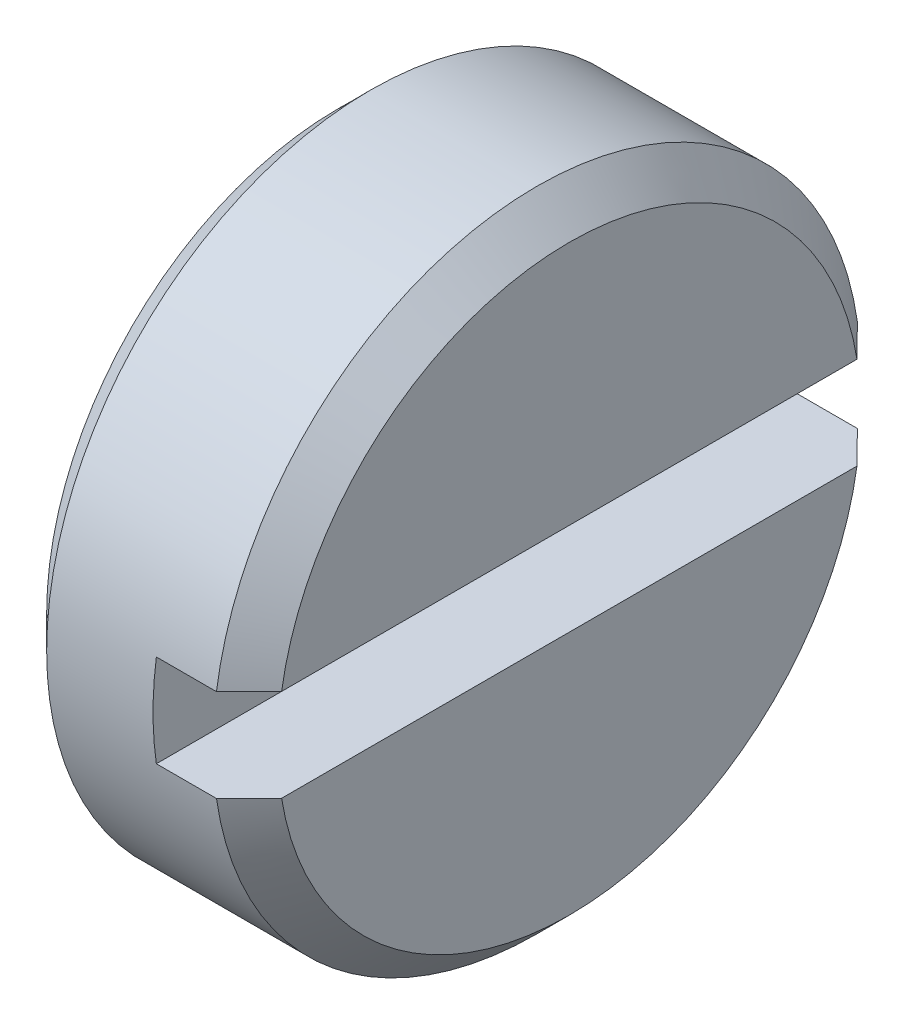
ISO-10303-21;
HEADER;
FILE_DESCRIPTION(('STEP AP214'),'2;1');
FILE_NAME('part.step','',(''),(''),'','','');
FILE_SCHEMA(('AUTOMOTIVE_DESIGN { 1 0 10303 214 1 1 1 1 }'));
ENDSEC;
DATA;
#1=APPLICATION_CONTEXT('core data for automotive mechanical design processes');
#2=APPLICATION_PROTOCOL_DEFINITION('international standard','automotive_design',2000,#1);
#3=PRODUCT_CONTEXT('',#1,'mechanical');
#4=PRODUCT('Part','Part','',(#3));
#5=PRODUCT_RELATED_PRODUCT_CATEGORY('part','',(#4));
#6=PRODUCT_DEFINITION_FORMATION('','',#4);
#7=PRODUCT_DEFINITION_CONTEXT('part definition',#1,'design');
#8=PRODUCT_DEFINITION('design','',#6,#7);
#9=PRODUCT_DEFINITION_SHAPE('','',#8);
#10=(LENGTH_UNIT() NAMED_UNIT(*) SI_UNIT(.MILLI.,.METRE.));
#11=(NAMED_UNIT(*) PLANE_ANGLE_UNIT() SI_UNIT($,.RADIAN.));
#12=(NAMED_UNIT(*) SI_UNIT($,.STERADIAN.) SOLID_ANGLE_UNIT());
#13=UNCERTAINTY_MEASURE_WITH_UNIT(LENGTH_MEASURE(1.E-05),#10,'distance_accuracy_value','');
#14=(GEOMETRIC_REPRESENTATION_CONTEXT(3) GLOBAL_UNCERTAINTY_ASSIGNED_CONTEXT((#13)) GLOBAL_UNIT_ASSIGNED_CONTEXT((#10,
#11,#12)) REPRESENTATION_CONTEXT('',''));
#15=CARTESIAN_POINT('',(0.,0.,0.));
#16=DIRECTION('',(0.,0.,1.));
#17=DIRECTION('',(1.,0.,0.));
#18=AXIS2_PLACEMENT_3D('',#15,#16,#17);
#19=CARTESIAN_POINT('',(3.,1.,8.39999999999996));
#20=DIRECTION('',(-1.,0.,0.));
#21=DIRECTION('',(0.,0.,1.));
#22=AXIS2_PLACEMENT_3D('',#19,#20,#21);
#23=PLANE('',#22);
#24=DIRECTION('',(0.,0.,-1.));
#25=VECTOR('',#24,1.);
#26=CARTESIAN_POINT('',(3.,-1.,8.39999999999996));
#27=LINE('',#26,#25);
#28=CARTESIAN_POINT('',(3.,-1.,6.92820323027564));
#29=VERTEX_POINT('',#28);
#30=CARTESIAN_POINT('',(3.,-1.,-6.92820323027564));
#31=VERTEX_POINT('',#30);
#32=EDGE_CURVE('E97',#29,#31,#27,.T.);
#33=ORIENTED_EDGE('',*,*,#32,.T.);
#34=CARTESIAN_POINT('',(3.,0.,0.));
#35=DIRECTION('',(1.,0.,0.));
#36=DIRECTION('',(0.,0.,-1.));
#37=AXIS2_PLACEMENT_3D('',#34,#35,#36);
#38=CIRCLE('',#37,7.);
#39=CARTESIAN_POINT('',(3.,1.,-6.92820323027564));
#40=VERTEX_POINT('',#39);
#41=EDGE_CURVE('E19',#40,#31,#38,.F.);
#42=ORIENTED_EDGE('',*,*,#41,.F.);
#43=DIRECTION('',(0.,0.,1.));
#44=VECTOR('',#43,1.);
#45=CARTESIAN_POINT('',(3.,1.,8.39999999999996));
#46=LINE('',#45,#44);
#47=CARTESIAN_POINT('',(3.,1.,6.92820323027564));
#48=VERTEX_POINT('',#47);
#49=EDGE_CURVE('E82',#40,#48,#46,.T.);
#50=ORIENTED_EDGE('',*,*,#49,.T.);
#51=CARTESIAN_POINT('',(3.,0.,0.));
#52=DIRECTION('',(1.,0.,0.));
#53=DIRECTION('',(0.,0.,-1.));
#54=AXIS2_PLACEMENT_3D('',#51,#52,#53);
#55=CIRCLE('',#54,7.);
#56=EDGE_CURVE('E71',#29,#48,#55,.F.);
#57=ORIENTED_EDGE('',*,*,#56,.F.);
#58=EDGE_LOOP('',(#33,#42,#50,#57));
#59=FACE_BOUND('',#58,.T.);
#60=ADVANCED_FACE('F16',(#59),#23,.F.);
#61=CARTESIAN_POINT('',(3.,-1.,8.39999999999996));
#62=DIRECTION('',(0.,-1.,0.));
#63=DIRECTION('',(0.,0.,-1.));
#64=AXIS2_PLACEMENT_3D('',#61,#62,#63);
#65=PLANE('',#64);
#66=ORIENTED_EDGE('',*,*,#32,.F.);
#67=DIRECTION('',(1.,0.,0.));
#68=VECTOR('',#67,1.);
#69=CARTESIAN_POINT('',(3.,-1.,6.92820323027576));
#70=LINE('',#69,#68);
#71=CARTESIAN_POINT('',(4.2999999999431,-1.,6.92820323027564));
#72=VERTEX_POINT('',#71);
#73=EDGE_CURVE('E78',#72,#29,#70,.F.);
#74=ORIENTED_EDGE('',*,*,#73,.F.);
#75=CARTESIAN_POINT('',(4.99999999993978,-1.,6.22012861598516));
#76=CARTESIAN_POINT('',(4.88340538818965,-1.,6.33821228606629));
#77=CARTESIAN_POINT('',(4.76677474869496,-1.,6.4562603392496));
#78=CARTESIAN_POINT('',(4.53344141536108,-1.,6.69228521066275));
#79=CARTESIAN_POINT('',(4.41673872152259,-1.,6.81026202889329));
#80=CARTESIAN_POINT('',(4.29999999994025,-1.,6.92820323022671));
#81=B_SPLINE_CURVE_WITH_KNOTS('',3,(#75,#76,#77,#78,#79,#80),.UNSPECIFIED.,.F.,.F.,(4,2,4),(0.,
0.497837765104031,0.995675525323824),.UNSPECIFIED.);
#82=CARTESIAN_POINT('',(4.99999999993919,-1.,6.22012861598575));
#83=VERTEX_POINT('',#82);
#84=EDGE_CURVE('E98',#83,#72,#81,.T.);
#85=ORIENTED_EDGE('',*,*,#84,.F.);
#86=DIRECTION('',(0.,0.,-1.));
#87=VECTOR('',#86,1.);
#88=CARTESIAN_POINT('',(5.,-1.,0.));
#89=LINE('',#88,#87);
#90=CARTESIAN_POINT('',(4.99999999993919,-1.,-6.22012861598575));
#91=VERTEX_POINT('',#90);
#92=EDGE_CURVE('E86',#91,#83,#89,.F.);
#93=ORIENTED_EDGE('',*,*,#92,.F.);
#94=CARTESIAN_POINT('',(4.29999999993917,-1.,-6.9282032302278));
#95=CARTESIAN_POINT('',(4.41673872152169,-1.,-6.81026202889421));
#96=CARTESIAN_POINT('',(4.53344141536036,-1.,-6.69228521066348));
#97=CARTESIAN_POINT('',(4.7667747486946,-1.,-6.45626033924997));
#98=CARTESIAN_POINT('',(4.88340538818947,-1.,-6.33821228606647));
#99=CARTESIAN_POINT('',(4.99999999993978,-1.,-6.22012861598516));
#100=B_SPLINE_CURVE_WITH_KNOTS('',3,(#94,#95,#96,#97,#98,#99),.UNSPECIFIED.,.F.,.F.,(4,2,4),(0.,
0.497837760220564,0.995675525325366),.UNSPECIFIED.);
#101=CARTESIAN_POINT('',(4.29999999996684,-1.,-6.92820323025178));
#102=VERTEX_POINT('',#101);
#103=EDGE_CURVE('E80',#102,#91,#100,.T.);
#104=ORIENTED_EDGE('',*,*,#103,.F.);
#105=DIRECTION('',(1.,0.,0.));
#106=VECTOR('',#105,1.);
#107=CARTESIAN_POINT('',(3.,-1.,-6.92820323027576));
#108=LINE('',#107,#106);
#109=EDGE_CURVE('E100',#31,#102,#108,.T.);
#110=ORIENTED_EDGE('',*,*,#109,.F.);
#111=EDGE_LOOP('',(#66,#74,#85,#93,#104,#110));
#112=FACE_BOUND('',#111,.T.);
#113=ADVANCED_FACE('F145',(#112),#65,.F.);
#114=CARTESIAN_POINT('',(5.,1.,8.39999999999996));
#115=DIRECTION('',(0.,1.,0.));
#116=DIRECTION('',(0.,0.,1.));
#117=AXIS2_PLACEMENT_3D('',#114,#115,#116);
#118=PLANE('',#117);
#119=ORIENTED_EDGE('',*,*,#49,.F.);
#120=DIRECTION('',(1.,0.,0.));
#121=VECTOR('',#120,1.);
#122=CARTESIAN_POINT('',(5.,1.,-6.92820323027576));
#123=LINE('',#122,#121);
#124=CARTESIAN_POINT('',(4.2999999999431,1.,-6.92820323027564));
#125=VERTEX_POINT('',#124);
#126=EDGE_CURVE('E88',#125,#40,#123,.F.);
#127=ORIENTED_EDGE('',*,*,#126,.F.);
#128=CARTESIAN_POINT('',(4.99999999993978,1.,-6.22012861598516));
#129=CARTESIAN_POINT('',(4.88340538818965,1.,-6.33821228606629));
#130=CARTESIAN_POINT('',(4.76677474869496,1.,-6.4562603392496));
#131=CARTESIAN_POINT('',(4.53344141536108,1.,-6.69228521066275));
#132=CARTESIAN_POINT('',(4.41673872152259,1.,-6.81026202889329));
#133=CARTESIAN_POINT('',(4.29999999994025,1.,-6.92820323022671));
#134=B_SPLINE_CURVE_WITH_KNOTS('',3,(#128,#129,#130,#131,#132,#133),.UNSPECIFIED.,.F.,.F.,(4,2,
4),(0.,0.497837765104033,0.995675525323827),.UNSPECIFIED.);
#135=CARTESIAN_POINT('',(4.99999999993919,1.,-6.22012861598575));
#136=VERTEX_POINT('',#135);
#137=EDGE_CURVE('E34',#136,#125,#134,.T.);
#138=ORIENTED_EDGE('',*,*,#137,.F.);
#139=DIRECTION('',(0.,0.,-1.));
#140=VECTOR('',#139,1.);
#141=CARTESIAN_POINT('',(5.,1.,0.));
#142=LINE('',#141,#140);
#143=CARTESIAN_POINT('',(4.99999999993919,1.,6.22012861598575));
#144=VERTEX_POINT('',#143);
#145=EDGE_CURVE('E110',#144,#136,#142,.T.);
#146=ORIENTED_EDGE('',*,*,#145,.F.);
#147=CARTESIAN_POINT('',(4.29999999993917,1.,6.9282032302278));
#148=CARTESIAN_POINT('',(4.41673872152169,1.,6.81026202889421));
#149=CARTESIAN_POINT('',(4.53344141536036,1.,6.69228521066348));
#150=CARTESIAN_POINT('',(4.7667747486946,1.,6.45626033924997));
#151=CARTESIAN_POINT('',(4.88340538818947,1.,6.33821228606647));
#152=CARTESIAN_POINT('',(4.99999999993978,1.,6.22012861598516));
#153=B_SPLINE_CURVE_WITH_KNOTS('',3,(#147,#148,#149,#150,#151,#152),.UNSPECIFIED.,.F.,.F.,(4,2,
4),(0.,0.497837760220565,0.995675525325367),.UNSPECIFIED.);
#154=CARTESIAN_POINT('',(4.29999999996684,1.,6.92820323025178));
#155=VERTEX_POINT('',#154);
#156=EDGE_CURVE('E84',#155,#144,#153,.T.);
#157=ORIENTED_EDGE('',*,*,#156,.F.);
#158=DIRECTION('',(1.,0.,0.));
#159=VECTOR('',#158,1.);
#160=CARTESIAN_POINT('',(5.,1.,6.92820323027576));
#161=LINE('',#160,#159);
#162=EDGE_CURVE('E76',#48,#155,#161,.T.);
#163=ORIENTED_EDGE('',*,*,#162,.F.);
#164=EDGE_LOOP('',(#119,#127,#138,#146,#157,#163));
#165=FACE_BOUND('',#164,.T.);
#166=ADVANCED_FACE('F81',(#165),#118,.F.);
#167=CARTESIAN_POINT('',(5.,0.,0.));
#168=DIRECTION('',(1.,0.,0.));
#169=DIRECTION('',(0.,0.,-1.));
#170=AXIS2_PLACEMENT_3D('',#167,#168,#169);
#171=PLANE('',#170);
#172=CARTESIAN_POINT('',(4.99999999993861,0.,0.));
#173=DIRECTION('',(-1.,0.,0.));
#174=DIRECTION('',(0.,0.,1.));
#175=AXIS2_PLACEMENT_3D('',#172,#173,#174);
#176=CIRCLE('',#175,6.29999999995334);
#177=EDGE_CURVE('E107',#91,#83,#176,.T.);
#178=ORIENTED_EDGE('',*,*,#177,.F.);
#179=ORIENTED_EDGE('',*,*,#92,.T.);
#180=EDGE_LOOP('',(#178,#179));
#181=FACE_BOUND('',#180,.T.);
#182=ADVANCED_FACE('F155',(#181),#171,.T.);
#183=CARTESIAN_POINT('',(5.,0.,0.));
#184=DIRECTION('',(1.,0.,0.));
#185=DIRECTION('',(0.,0.,-1.));
#186=AXIS2_PLACEMENT_3D('',#183,#184,#185);
#187=PLANE('',#186);
#188=CARTESIAN_POINT('',(4.99999999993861,0.,0.));
#189=DIRECTION('',(-1.,0.,0.));
#190=DIRECTION('',(0.,0.,1.));
#191=AXIS2_PLACEMENT_3D('',#188,#189,#190);
#192=CIRCLE('',#191,6.29999999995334);
#193=EDGE_CURVE('E103',#144,#136,#192,.T.);
#194=ORIENTED_EDGE('',*,*,#193,.F.);
#195=ORIENTED_EDGE('',*,*,#145,.T.);
#196=EDGE_LOOP('',(#194,#195));
#197=FACE_BOUND('',#196,.T.);
#198=ADVANCED_FACE('F135',(#197),#187,.T.);
#199=CARTESIAN_POINT('',(4.30000000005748,0.,0.));
#200=DIRECTION('',(-1.,0.,0.));
#201=DIRECTION('',(0.,0.,1.));
#202=AXIS2_PLACEMENT_3D('',#199,#200,#201);
#203=CONICAL_SURFACE('',#202,6.99999999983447,0.785398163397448);
#204=CARTESIAN_POINT('',(4.2999999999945,0.,0.));
#205=DIRECTION('',(1.,0.,0.));
#206=DIRECTION('',(0.,0.,-1.));
#207=AXIS2_PLACEMENT_3D('',#204,#205,#206);
#208=CIRCLE('',#207,7.);
#209=EDGE_CURVE('E95',#102,#72,#208,.F.);
#210=ORIENTED_EDGE('',*,*,#209,.F.);
#211=ORIENTED_EDGE('',*,*,#103,.T.);
#212=ORIENTED_EDGE('',*,*,#177,.T.);
#213=ORIENTED_EDGE('',*,*,#84,.T.);
#214=EDGE_LOOP('',(#210,#211,#212,#213));
#215=FACE_BOUND('',#214,.T.);
#216=ADVANCED_FACE('F128',(#215),#203,.T.);
#217=CARTESIAN_POINT('',(4.30000000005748,0.,0.));
#218=DIRECTION('',(-1.,0.,0.));
#219=DIRECTION('',(0.,0.,1.));
#220=AXIS2_PLACEMENT_3D('',#217,#218,#219);
#221=CONICAL_SURFACE('',#220,6.99999999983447,0.785398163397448);
#222=CARTESIAN_POINT('',(4.2999999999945,0.,0.));
#223=DIRECTION('',(1.,0.,0.));
#224=DIRECTION('',(0.,0.,-1.));
#225=AXIS2_PLACEMENT_3D('',#222,#223,#224);
#226=CIRCLE('',#225,7.);
#227=EDGE_CURVE('E93',#155,#125,#226,.F.);
#228=ORIENTED_EDGE('',*,*,#227,.F.);
#229=ORIENTED_EDGE('',*,*,#156,.T.);
#230=ORIENTED_EDGE('',*,*,#193,.T.);
#231=ORIENTED_EDGE('',*,*,#137,.T.);
#232=EDGE_LOOP('',(#228,#229,#230,#231));
#233=FACE_BOUND('',#232,.T.);
#234=ADVANCED_FACE('F123',(#233),#221,.T.);
#235=CARTESIAN_POINT('',(-0.25,0.,0.));
#236=DIRECTION('',(1.,0.,0.));
#237=DIRECTION('',(0.,0.,-1.));
#238=AXIS2_PLACEMENT_3D('',#235,#236,#237);
#239=CYLINDRICAL_SURFACE('',#238,7.);
#240=ORIENTED_EDGE('',*,*,#56,.T.);
#241=ORIENTED_EDGE('',*,*,#162,.T.);
#242=ORIENTED_EDGE('',*,*,#227,.T.);
#243=ORIENTED_EDGE('',*,*,#126,.T.);
#244=ORIENTED_EDGE('',*,*,#41,.T.);
#245=ORIENTED_EDGE('',*,*,#109,.T.);
#246=ORIENTED_EDGE('',*,*,#209,.T.);
#247=ORIENTED_EDGE('',*,*,#73,.T.);
#248=EDGE_LOOP('',(#240,#241,#242,#243,#244,#245,#246,#247));
#249=FACE_BOUND('',#248,.T.);
#250=CARTESIAN_POINT('',(0.700000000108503,0.,0.));
#251=DIRECTION('',(1.,0.,0.));
#252=DIRECTION('',(0.,0.,-1.));
#253=AXIS2_PLACEMENT_3D('',#250,#251,#252);
#254=CIRCLE('',#253,6.99999999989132);
#255=CARTESIAN_POINT('',(0.700000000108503,0.,-6.99999999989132));
#256=VERTEX_POINT('',#255);
#257=EDGE_CURVE('E25',#256,#256,#254,.F.);
#258=ORIENTED_EDGE('',*,*,#257,.F.);
#259=EDGE_LOOP('',(#258));
#260=FACE_BOUND('',#259,.T.);
#261=ADVANCED_FACE('F73',(#249,#260),#239,.T.);
#262=CARTESIAN_POINT('',(0.699999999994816,0.,0.));
#263=DIRECTION('',(1.,0.,0.));
#264=DIRECTION('',(0.,0.,-1.));
#265=AXIS2_PLACEMENT_3D('',#262,#263,#264);
#266=CONICAL_SURFACE('',#265,6.99999999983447,0.785398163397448);
#267=ORIENTED_EDGE('',*,*,#257,.T.);
#268=EDGE_LOOP('',(#267));
#269=FACE_BOUND('',#268,.T.);
#270=CARTESIAN_POINT('',(1.13686837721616E-10,0.,0.));
#271=DIRECTION('',(1.,0.,0.));
#272=DIRECTION('',(0.,0.,-1.));
#273=AXIS2_PLACEMENT_3D('',#270,#271,#272);
#274=CIRCLE('',#273,6.29999999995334);
#275=CARTESIAN_POINT('',(1.13686837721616E-10,0.,-6.29999999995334));
#276=VERTEX_POINT('',#275);
#277=EDGE_CURVE('E11',#276,#276,#274,.T.);
#278=ORIENTED_EDGE('',*,*,#277,.T.);
#279=EDGE_LOOP('',(#278));
#280=FACE_BOUND('',#279,.T.);
#281=ADVANCED_FACE('F158',(#269,#280),#266,.T.);
#282=CARTESIAN_POINT('',(0.,0.,0.));
#283=DIRECTION('',(1.,0.,0.));
#284=DIRECTION('',(0.,0.,-1.));
#285=AXIS2_PLACEMENT_3D('',#282,#283,#284);
#286=PLANE('',#285);
#287=ORIENTED_EDGE('',*,*,#277,.F.);
#288=EDGE_LOOP('',(#287));
#289=FACE_BOUND('',#288,.T.);
#290=ADVANCED_FACE('F156',(#289),#286,.F.);
#291=CLOSED_SHELL('',(#60,#113,#166,#182,#198,#216,#234,#261,#281,#290));
#292=MANIFOLD_SOLID_BREP('B1',#291);
#293=ADVANCED_BREP_SHAPE_REPRESENTATION('',(#18,#292),#14);
#294=SHAPE_DEFINITION_REPRESENTATION(#9,#293);
ENDSEC;
END-ISO-10303-21;
